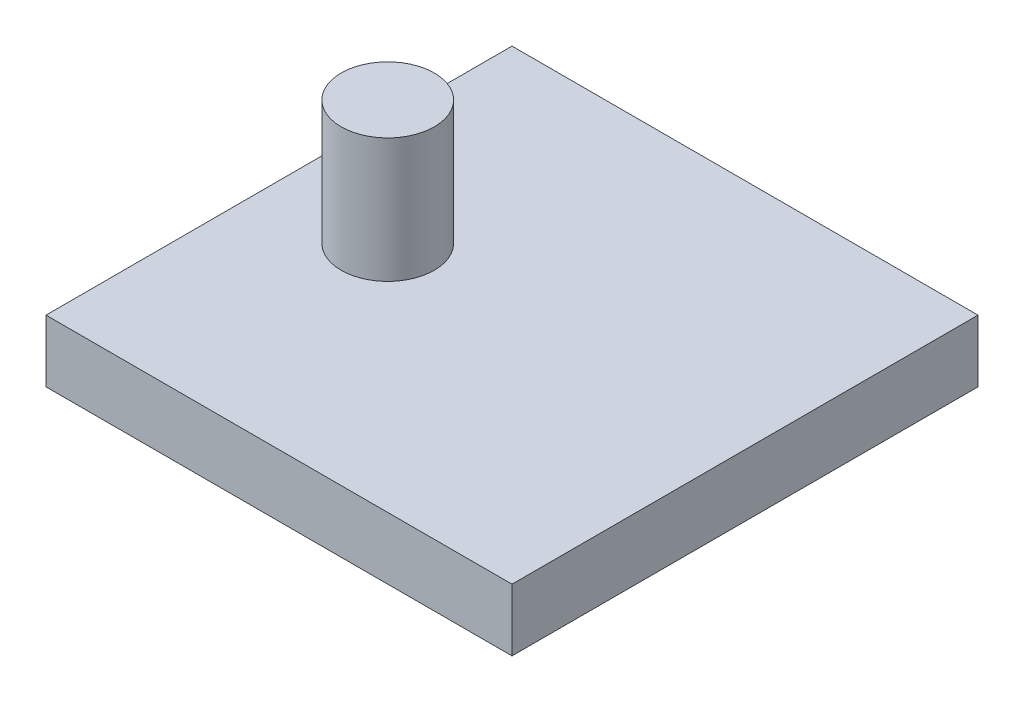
ISO-10303-21;
HEADER;
FILE_DESCRIPTION(('STEP AP214'),'2;1');
FILE_NAME('part.step','',(''),(''),'','','');
FILE_SCHEMA(('AUTOMOTIVE_DESIGN { 1 0 10303 214 1 1 1 1 }'));
ENDSEC;
DATA;
#1=APPLICATION_CONTEXT('core data for automotive mechanical design processes');
#2=APPLICATION_PROTOCOL_DEFINITION('international standard','automotive_design',2000,#1);
#3=PRODUCT_CONTEXT('',#1,'mechanical');
#4=PRODUCT('Part','Part','',(#3));
#5=PRODUCT_RELATED_PRODUCT_CATEGORY('part','',(#4));
#6=PRODUCT_DEFINITION_FORMATION('','',#4);
#7=PRODUCT_DEFINITION_CONTEXT('part definition',#1,'design');
#8=PRODUCT_DEFINITION('design','',#6,#7);
#9=PRODUCT_DEFINITION_SHAPE('','',#8);
#10=(LENGTH_UNIT() NAMED_UNIT(*) SI_UNIT(.MILLI.,.METRE.));
#11=(NAMED_UNIT(*) PLANE_ANGLE_UNIT() SI_UNIT($,.RADIAN.));
#12=(NAMED_UNIT(*) SI_UNIT($,.STERADIAN.) SOLID_ANGLE_UNIT());
#13=UNCERTAINTY_MEASURE_WITH_UNIT(LENGTH_MEASURE(1.E-05),#10,'distance_accuracy_value','');
#14=(GEOMETRIC_REPRESENTATION_CONTEXT(3) GLOBAL_UNCERTAINTY_ASSIGNED_CONTEXT((#13)) GLOBAL_UNIT_ASSIGNED_CONTEXT((#10,
#11,#12)) REPRESENTATION_CONTEXT('',''));
#15=CARTESIAN_POINT('',(0.,0.,0.));
#16=DIRECTION('',(0.,0.,1.));
#17=DIRECTION('',(1.,0.,0.));
#18=AXIS2_PLACEMENT_3D('',#15,#16,#17);
#19=CARTESIAN_POINT('',(-75.,20.,75.));
#20=DIRECTION('',(0.,1.,0.));
#21=DIRECTION('',(0.,0.,1.));
#22=AXIS2_PLACEMENT_3D('',#19,#20,#21);
#23=PLANE('',#22);
#24=DIRECTION('',(0.,0.,1.));
#25=VECTOR('',#24,1.);
#26=CARTESIAN_POINT('',(-75.,20.,-75.));
#27=LINE('',#26,#25);
#28=CARTESIAN_POINT('',(-75.,20.,-75.));
#29=VERTEX_POINT('',#28);
#30=CARTESIAN_POINT('',(-75.,20.,75.));
#31=VERTEX_POINT('',#30);
#32=EDGE_CURVE('E94',#29,#31,#27,.T.);
#33=ORIENTED_EDGE('',*,*,#32,.T.);
#34=DIRECTION('',(1.,0.,0.));
#35=VECTOR('',#34,1.);
#36=CARTESIAN_POINT('',(-75.,20.,75.));
#37=LINE('',#36,#35);
#38=CARTESIAN_POINT('',(75.,20.,75.));
#39=VERTEX_POINT('',#38);
#40=EDGE_CURVE('E79',#31,#39,#37,.T.);
#41=ORIENTED_EDGE('',*,*,#40,.T.);
#42=DIRECTION('',(0.,0.,-1.));
#43=VECTOR('',#42,1.);
#44=CARTESIAN_POINT('',(75.,20.,-75.));
#45=LINE('',#44,#43);
#46=CARTESIAN_POINT('',(75.,20.,-75.));
#47=VERTEX_POINT('',#46);
#48=EDGE_CURVE('E46',#39,#47,#45,.T.);
#49=ORIENTED_EDGE('',*,*,#48,.T.);
#50=DIRECTION('',(-1.,0.,0.));
#51=VECTOR('',#50,1.);
#52=CARTESIAN_POINT('',(-75.,20.,-75.));
#53=LINE('',#52,#51);
#54=EDGE_CURVE('E41',#47,#29,#53,.T.);
#55=ORIENTED_EDGE('',*,*,#54,.T.);
#56=EDGE_LOOP('',(#33,#41,#49,#55));
#57=FACE_BOUND('',#56,.T.);
#58=CARTESIAN_POINT('',(-40.,20.,0.));
#59=DIRECTION('',(0.,1.,0.));
#60=DIRECTION('',(0.,0.,1.));
#61=AXIS2_PLACEMENT_3D('',#58,#59,#60);
#62=CIRCLE('',#61,15.);
#63=CARTESIAN_POINT('',(-40.,20.,15.));
#64=VERTEX_POINT('',#63);
#65=EDGE_CURVE('E87',#64,#64,#62,.T.);
#66=ORIENTED_EDGE('',*,*,#65,.F.);
#67=EDGE_LOOP('',(#66));
#68=FACE_BOUND('',#67,.T.);
#69=ADVANCED_FACE('F26',(#57,#68),#23,.T.);
#70=CARTESIAN_POINT('',(-75.,20.,-75.));
#71=DIRECTION('',(1.,0.,0.));
#72=DIRECTION('',(0.,0.,-1.));
#73=AXIS2_PLACEMENT_3D('',#70,#71,#72);
#74=PLANE('',#73);
#75=DIRECTION('',(0.,0.,1.));
#76=VECTOR('',#75,1.);
#77=CARTESIAN_POINT('',(-75.,0.,-75.));
#78=LINE('',#77,#76);
#79=CARTESIAN_POINT('',(-75.,0.,-75.));
#80=VERTEX_POINT('',#79);
#81=CARTESIAN_POINT('',(-75.,0.,75.));
#82=VERTEX_POINT('',#81);
#83=EDGE_CURVE('E71',#80,#82,#78,.T.);
#84=ORIENTED_EDGE('',*,*,#83,.T.);
#85=DIRECTION('',(0.,-1.,0.));
#86=VECTOR('',#85,1.);
#87=CARTESIAN_POINT('',(-75.,20.,75.));
#88=LINE('',#87,#86);
#89=EDGE_CURVE('E11',#31,#82,#88,.T.);
#90=ORIENTED_EDGE('',*,*,#89,.F.);
#91=ORIENTED_EDGE('',*,*,#32,.F.);
#92=DIRECTION('',(0.,-1.,0.));
#93=VECTOR('',#92,1.);
#94=CARTESIAN_POINT('',(-75.,20.,-75.));
#95=LINE('',#94,#93);
#96=EDGE_CURVE('E83',#29,#80,#95,.T.);
#97=ORIENTED_EDGE('',*,*,#96,.T.);
#98=EDGE_LOOP('',(#84,#90,#91,#97));
#99=FACE_BOUND('',#98,.T.);
#100=ADVANCED_FACE('F28',(#99),#74,.F.);
#101=CARTESIAN_POINT('',(-75.,20.,75.));
#102=DIRECTION('',(0.,0.,-1.));
#103=DIRECTION('',(-1.,0.,0.));
#104=AXIS2_PLACEMENT_3D('',#101,#102,#103);
#105=PLANE('',#104);
#106=DIRECTION('',(1.,0.,0.));
#107=VECTOR('',#106,1.);
#108=CARTESIAN_POINT('',(-75.,0.,75.));
#109=LINE('',#108,#107);
#110=CARTESIAN_POINT('',(75.,0.,75.));
#111=VERTEX_POINT('',#110);
#112=EDGE_CURVE('E67',#82,#111,#109,.T.);
#113=ORIENTED_EDGE('',*,*,#112,.T.);
#114=DIRECTION('',(0.,-1.,0.));
#115=VECTOR('',#114,1.);
#116=CARTESIAN_POINT('',(75.,20.,75.));
#117=LINE('',#116,#115);
#118=EDGE_CURVE('E34',#39,#111,#117,.T.);
#119=ORIENTED_EDGE('',*,*,#118,.F.);
#120=ORIENTED_EDGE('',*,*,#40,.F.);
#121=ORIENTED_EDGE('',*,*,#89,.T.);
#122=EDGE_LOOP('',(#113,#119,#120,#121));
#123=FACE_BOUND('',#122,.T.);
#124=ADVANCED_FACE('F78',(#123),#105,.F.);
#125=CARTESIAN_POINT('',(75.,20.,-75.));
#126=DIRECTION('',(-1.,0.,0.));
#127=DIRECTION('',(0.,0.,1.));
#128=AXIS2_PLACEMENT_3D('',#125,#126,#127);
#129=PLANE('',#128);
#130=DIRECTION('',(0.,0.,-1.));
#131=VECTOR('',#130,1.);
#132=CARTESIAN_POINT('',(75.,0.,-75.));
#133=LINE('',#132,#131);
#134=CARTESIAN_POINT('',(75.,0.,-75.));
#135=VERTEX_POINT('',#134);
#136=EDGE_CURVE('E72',#111,#135,#133,.T.);
#137=ORIENTED_EDGE('',*,*,#136,.T.);
#138=DIRECTION('',(0.,-1.,0.));
#139=VECTOR('',#138,1.);
#140=CARTESIAN_POINT('',(75.,20.,-75.));
#141=LINE('',#140,#139);
#142=EDGE_CURVE('E100',#47,#135,#141,.T.);
#143=ORIENTED_EDGE('',*,*,#142,.F.);
#144=ORIENTED_EDGE('',*,*,#48,.F.);
#145=ORIENTED_EDGE('',*,*,#118,.T.);
#146=EDGE_LOOP('',(#137,#143,#144,#145));
#147=FACE_BOUND('',#146,.T.);
#148=ADVANCED_FACE('F103',(#147),#129,.F.);
#149=CARTESIAN_POINT('',(-75.,20.,-75.));
#150=DIRECTION('',(0.,0.,1.));
#151=DIRECTION('',(1.,0.,0.));
#152=AXIS2_PLACEMENT_3D('',#149,#150,#151);
#153=PLANE('',#152);
#154=DIRECTION('',(-1.,0.,0.));
#155=VECTOR('',#154,1.);
#156=CARTESIAN_POINT('',(-75.,0.,-75.));
#157=LINE('',#156,#155);
#158=EDGE_CURVE('E92',#135,#80,#157,.T.);
#159=ORIENTED_EDGE('',*,*,#158,.T.);
#160=ORIENTED_EDGE('',*,*,#96,.F.);
#161=ORIENTED_EDGE('',*,*,#54,.F.);
#162=ORIENTED_EDGE('',*,*,#142,.T.);
#163=EDGE_LOOP('',(#159,#160,#161,#162));
#164=FACE_BOUND('',#163,.T.);
#165=ADVANCED_FACE('F105',(#164),#153,.F.);
#166=CARTESIAN_POINT('',(-75.,0.,75.));
#167=DIRECTION('',(0.,1.,0.));
#168=DIRECTION('',(0.,0.,1.));
#169=AXIS2_PLACEMENT_3D('',#166,#167,#168);
#170=PLANE('',#169);
#171=ORIENTED_EDGE('',*,*,#83,.F.);
#172=ORIENTED_EDGE('',*,*,#158,.F.);
#173=ORIENTED_EDGE('',*,*,#136,.F.);
#174=ORIENTED_EDGE('',*,*,#112,.F.);
#175=EDGE_LOOP('',(#171,#172,#173,#174));
#176=FACE_BOUND('',#175,.T.);
#177=ADVANCED_FACE('F68',(#176),#170,.F.);
#178=CARTESIAN_POINT('',(-40.,60.,0.));
#179=DIRECTION('',(0.,-1.,0.));
#180=DIRECTION('',(0.,0.,-1.));
#181=AXIS2_PLACEMENT_3D('',#178,#179,#180);
#182=CYLINDRICAL_SURFACE('',#181,15.);
#183=CARTESIAN_POINT('',(-40.,60.,0.));
#184=DIRECTION('',(0.,1.,0.));
#185=DIRECTION('',(0.,0.,1.));
#186=AXIS2_PLACEMENT_3D('',#183,#184,#185);
#187=CIRCLE('',#186,15.);
#188=CARTESIAN_POINT('',(-40.,60.,15.));
#189=VERTEX_POINT('',#188);
#190=EDGE_CURVE('E84',#189,#189,#187,.T.);
#191=ORIENTED_EDGE('',*,*,#190,.F.);
#192=EDGE_LOOP('',(#191));
#193=FACE_BOUND('',#192,.T.);
#194=ORIENTED_EDGE('',*,*,#65,.T.);
#195=EDGE_LOOP('',(#194));
#196=FACE_BOUND('',#195,.T.);
#197=ADVANCED_FACE('F112',(#193,#196),#182,.T.);
#198=CARTESIAN_POINT('',(-40.,60.,0.));
#199=DIRECTION('',(0.,1.,0.));
#200=DIRECTION('',(0.,0.,1.));
#201=AXIS2_PLACEMENT_3D('',#198,#199,#200);
#202=PLANE('',#201);
#203=ORIENTED_EDGE('',*,*,#190,.T.);
#204=EDGE_LOOP('',(#203));
#205=FACE_BOUND('',#204,.T.);
#206=ADVANCED_FACE('F114',(#205),#202,.T.);
#207=CLOSED_SHELL('',(#69,#100,#124,#148,#165,#177,#197,#206));
#208=MANIFOLD_SOLID_BREP('B2',#207);
#209=ADVANCED_BREP_SHAPE_REPRESENTATION('',(#18,#208),#14);
#210=SHAPE_DEFINITION_REPRESENTATION(#9,#209);
ENDSEC;
END-ISO-10303-21;
